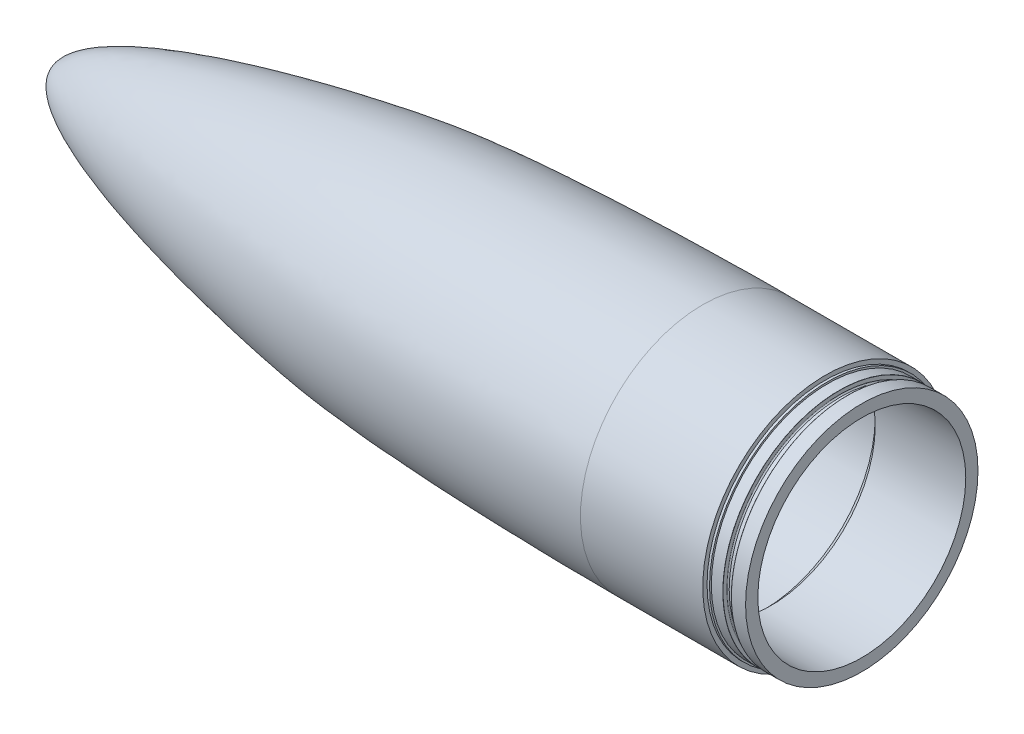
from build123d import *


with BuildPart() as part:
    # Esquisse1 → R_volution1 (revolve)
    with BuildSketch(Plane.XY, mode=Mode.PRIVATE) as r_volution1_sk:
        with BuildLine():
            Line((0, 100), (-100, 100))
            add(Edge.make_bspline(
                [(-100, 100), (-162.133323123, 100), (-304.534862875, 97.422570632), (-476.671134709, 71.310261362), (-630, 34.084755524), (-630, 0)],
                knots=[0, 0, 0, 0, 0.341762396, 0.441762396, 1, 1, 1, 1], degree=3))
            Line((-630, 0), (-623.6, 0))
            add(Edge.make_bspline(
                [(-280.170467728, 89.012283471), (-287.472773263, 88.603918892), (-302.288800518, 87.693244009), (-323.575500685, 86.088305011), (-343.634458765, 84.201217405), (-361.69470116, 82.050848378), (-378.640427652, 79.632054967), (-400.788613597, 76.040344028), (-429.814433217, 70.862000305), (-465.575885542, 63.667555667), (-500.879191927, 55.592935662), (-534.375414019, 46.748182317), (-564.687362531, 37.252390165), (-586.12269833, 28.914054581), (-600.228733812, 22.106709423), (-609.082536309, 16.989532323), (-615.995841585, 11.956157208), (-619.952563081, 7.988969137), (-621.98614959, 5.129446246), (-622.975069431, 3.200494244), (-623.496626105, 1.497317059), (-623.6, 0.514775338), (-623.6, 0)],
                knots=[0.251889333, 0.251889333, 0.251889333, 0.251889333, 0.28125, 0.3125, 0.34375, 0.375, 0.40625, 0.4375, 0.5, 0.5625, 0.625, 0.6875, 0.75, 0.8125, 0.84375, 0.875, 0.90625, 0.9375, 0.953125, 0.96875, 0.984375, 1, 1, 1, 1], degree=3))
            Line((-280.170467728, 89.012283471), (-178.987716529, 89.012283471))
            Line((-178.987716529, 89.012283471), (-177.0069108, 90.9930892))
            Line((-177.0069108, 90.9930892), (-50, 90.9930892))
            Line((-50, 90.9930892), (-44.0069108, 85))
            Line((-44.0069108, 85), (30, 85))
            Line((30, 85), (30, 95))
            Line((30, 95), (18.4, 95))
            ThreePointArc((18.4, 95), (18.329289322, 94.970710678), (18.3, 94.9))
            Line((18.3, 94.9), (18.3, 91.9))
            ThreePointArc((18.3, 91.9), (18.007106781, 91.192893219), (17.3, 90.9))
            Line((17.3, 90.9), (12.5, 90.9))
            ThreePointArc((12.5, 90.9), (11.792893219, 91.192893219), (11.5, 91.9))
            Line((11.5, 91.9), (11.5, 94.9))
            ThreePointArc((11.5, 94.9), (11.470710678, 94.970710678), (11.4, 95))
            Line((11.4, 95), (2, 95))
            Line((2, 95), (2, 96.5))
            Line((2, 96.5), (0, 96.5))
            Line((0, 96.5), (0, 100))
        make_face()
    revolve(r_volution1_sk.sketch.rotate(Axis((20.14499821, 0, 0), (-1, 0, 0)), 90), axis=Axis((20.14499821, 0, 0), (-1, 0, 0)))


solid = part.part
